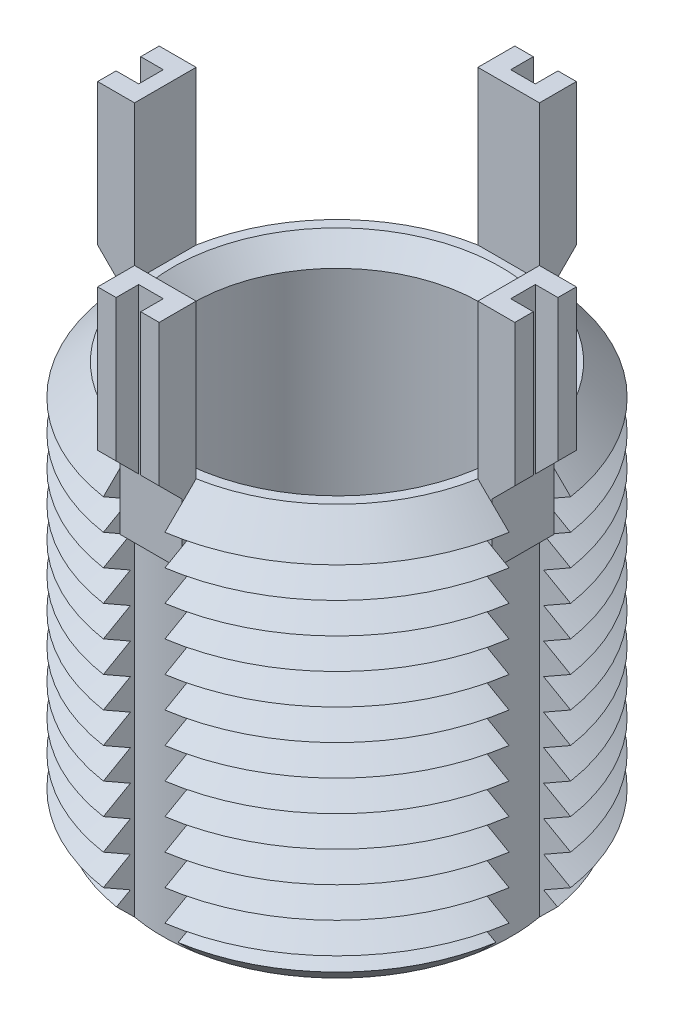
from build123d import *

# Parameters (mm, degrees)
SKETCH1_R               = 10
BOSS_EXTRUDE1_DEPTH     = 20
CHAMFER1_SIZE           = 1.5
LPATTERN1_COUNT         = 12
LPATTERN1_PITCH         = 1.5
CUT_EXTRUDE1_REACH      = 26.495
CIRPATTERN1_COUNT       = 4
BOSS_EXTRUDE3_DEPTH     = 1.5
CIRPATTERN2_COUNT       = 4
CUT_EXTRUDE3_DEPTH      = 32.031750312
CUT_EXTRUDE3_DEPTH_BACK = 32.031750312
SKETCH6_W               = 1.1
SKETCH6_H               = 1.2
SKETCH6_W_2             = 1.2
SKETCH6_H_2             = 1.1
SKETCH7_R               = 7
CUT_EXTRUDE4_DEPTH      = 20
CHAMFER2_SIZE           = 1


with BuildPart() as part:
    # Sketch1 → Boss-Extrude1 (new body)
    with BuildSketch(Plane(origin=(0, 0, 0), x_dir=(1, 0, 0), z_dir=(0, 1, 0))):
        with Locations(Location((0, 0, 0), (0, 0, 270))):
            Circle(SKETCH1_R)
    extrude(amount=-BOSS_EXTRUDE1_DEPTH)

    # Chamfer1
    chamfer1_edges = [part.edges().sort_by_distance(p)[0] for p in [
        (0, 0, -10),
        (0, -20, -10),
    ]]
    chamfer(chamfer1_edges, length=CHAMFER1_SIZE)

    # Sketch3 → Cut-Revolve1 (revolve, cut)
    with BuildSketch(Plane(origin=(0, 0, 0), x_dir=(0, 0, -1), z_dir=(1, 0, 0))):
        Polygon((-10, -1.5), (-8.700961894, -2.25), (-10, -3), align=None)
    cut_revolve1 = revolve(axis=Axis((0, 0.885892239, 0), (0, -1, 0)), mode=Mode.SUBTRACT)

    # LPattern1: Cut-Revolve1 ×12
    with Locations(*[(0, -i * LPATTERN1_PITCH, 0) for i in range(1, LPATTERN1_COUNT)]):
        add(cut_revolve1, mode=Mode.SUBTRACT)

    # Cut-Extrude1: up to this cone (the profile starts inside it)
    cut_extrude1_end = Plane(origin=(0, 0, 0), z_dir=(0, 1, 0)).offset(-28.499999) * Cone(1e-06, 83.995, 83.994999, align=(Align.CENTER, Align.CENTER, Align.MIN), mode=Mode.PRIVATE)
    # Sketch4 → Cut-Extrude1 (cut, up to the surface)
    with BuildSketch(Plane(origin=(0, 0, 0), x_dir=(1, 0, 0), z_dir=(0, 1, 0)), mode=Mode.PRIVATE) as cut_extrude1_sk1:
        with BuildLine():
            Line((-8.366600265, 1.5), (-9.886859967, 1.5))
            ThreePointArc((-9.886859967, 1.5), (-10, 0), (-9.886859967, -1.5))
            Line((-9.886859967, -1.5), (-8.366600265, -1.5))
            ThreePointArc((-8.366600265, -1.5), (-8.5, 0), (-8.366600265, 1.5))
        make_face()
    cut_extrude1_tool1 = extrude(cut_extrude1_sk1.sketch, amount=-CUT_EXTRUDE1_REACH, mode=Mode.PRIVATE) & cut_extrude1_end
    cut_extrude1 = cut_extrude1_tool1.solids().sort_by_distance((-9.208876, 0, 0))[0]
    add(cut_extrude1, mode=Mode.SUBTRACT)

    # CirPattern1: Cut-Extrude1 ×4 about axis
    cirpattern1_axis = Axis((0, 0, 0), (0, 1, 0))
    for i in range(1, CIRPATTERN1_COUNT):
        add(cut_extrude1.rotate(cirpattern1_axis, i * 360 / CIRPATTERN1_COUNT), mode=Mode.SUBTRACT)

    # Sketch5 → Boss-Extrude3 (add, symmetric)
    with BuildSketch(Plane(origin=(0, 0, 0), x_dir=(0, 0, -1), z_dir=(1, 0, 0))):
        Polygon((-8.366600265, 7.5), (-8.366600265, -3.5), (-9.066600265, -3.5), (-9.066600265, -0.5), (-10.166600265, 0.6), (-10.166600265, 7.5), align=None)
    boss_extrude3 = extrude(amount=BOSS_EXTRUDE3_DEPTH, both=True)

    # CirPattern2: Boss-Extrude3 ×4 about axis
    cirpattern2_axis = Axis((0, 0, 0), (0, 1, 0))
    for i in range(1, CIRPATTERN2_COUNT):
        add(boss_extrude3.rotate(cirpattern2_axis, i * 360 / CIRPATTERN2_COUNT))

    # Sketch6 → Cut-Extrude3 (cut, two sides: drawn at the far end of the back side and taken through both)
    with BuildSketch(Plane(origin=(0, 7.5, 0), x_dir=(1, 0, 0), z_dir=(0, 1, 0)).offset(-CUT_EXTRUDE3_DEPTH_BACK)):
        with Locations((-9.616600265, 0)):
            Rectangle(SKETCH6_W, SKETCH6_H)
        with Locations((0, 9.616600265)):
            Rectangle(SKETCH6_W_2, SKETCH6_H_2)
        with Locations((9.616600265, 0)):
            Rectangle(SKETCH6_W, SKETCH6_H)
        with Locations((0, -9.616600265)):
            Rectangle(SKETCH6_W_2, SKETCH6_H_2)
    extrude(amount=CUT_EXTRUDE3_DEPTH + CUT_EXTRUDE3_DEPTH_BACK, mode=Mode.SUBTRACT)

    # Sketch7 → Cut-Extrude4 (cut)
    with BuildSketch(Plane(origin=(0, 0, 0), x_dir=(1, 0, 0), z_dir=(0, 1, 0))):
        with Locations(Location((0, 0, 0), (0, 0, 270))):
            Circle(SKETCH7_R)
    extrude(amount=-CUT_EXTRUDE4_DEPTH, mode=Mode.SUBTRACT)

    # Chamfer2
    chamfer2_edges = [part.edges().sort_by_distance(p)[0] for p in [
        (0, 0, -7),
        (0, -20, -7),
    ]]
    chamfer(chamfer2_edges, length=CHAMFER2_SIZE)


solid = part.part
